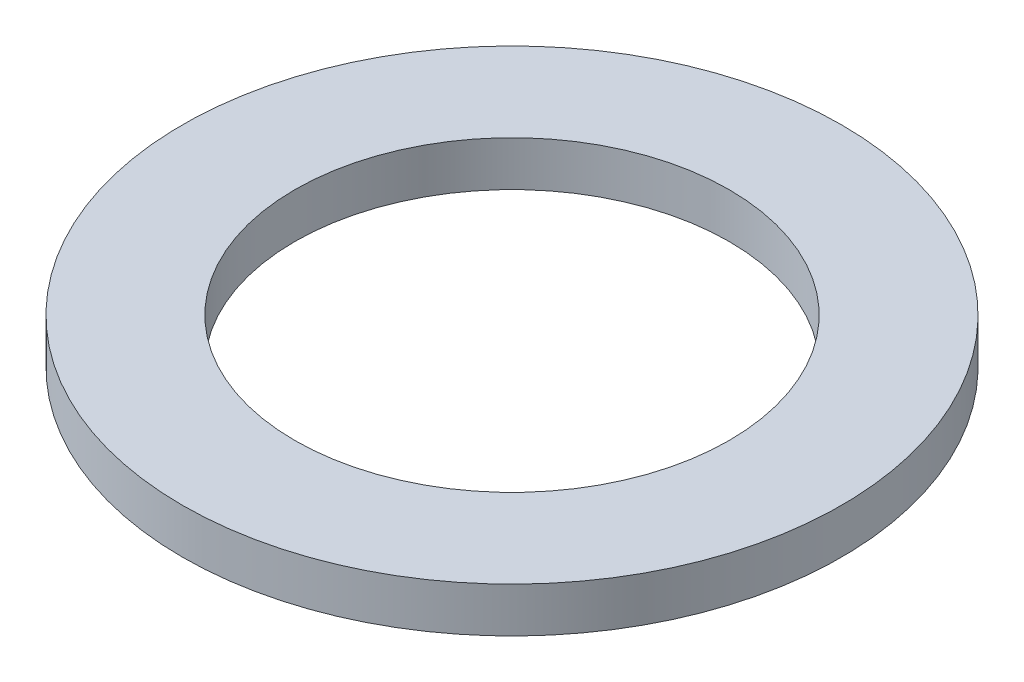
ISO-10303-21;
HEADER;
FILE_DESCRIPTION(('STEP AP214'),'2;1');
FILE_NAME('part.step','',(''),(''),'','','');
FILE_SCHEMA(('AUTOMOTIVE_DESIGN { 1 0 10303 214 1 1 1 1 }'));
ENDSEC;
DATA;
#1=APPLICATION_CONTEXT('core data for automotive mechanical design processes');
#2=APPLICATION_PROTOCOL_DEFINITION('international standard','automotive_design',2000,#1);
#3=PRODUCT_CONTEXT('',#1,'mechanical');
#4=PRODUCT('Part','Part','',(#3));
#5=PRODUCT_RELATED_PRODUCT_CATEGORY('part','',(#4));
#6=PRODUCT_DEFINITION_FORMATION('','',#4);
#7=PRODUCT_DEFINITION_CONTEXT('part definition',#1,'design');
#8=PRODUCT_DEFINITION('design','',#6,#7);
#9=PRODUCT_DEFINITION_SHAPE('','',#8);
#10=(LENGTH_UNIT() NAMED_UNIT(*) SI_UNIT(.MILLI.,.METRE.));
#11=(NAMED_UNIT(*) PLANE_ANGLE_UNIT() SI_UNIT($,.RADIAN.));
#12=(NAMED_UNIT(*) SI_UNIT($,.STERADIAN.) SOLID_ANGLE_UNIT());
#13=UNCERTAINTY_MEASURE_WITH_UNIT(LENGTH_MEASURE(1.E-05),#10,'distance_accuracy_value','');
#14=(GEOMETRIC_REPRESENTATION_CONTEXT(3) GLOBAL_UNCERTAINTY_ASSIGNED_CONTEXT((#13)) GLOBAL_UNIT_ASSIGNED_CONTEXT((#10,
#11,#12)) REPRESENTATION_CONTEXT('',''));
#15=CARTESIAN_POINT('',(0.,0.,0.));
#16=DIRECTION('',(0.,0.,1.));
#17=DIRECTION('',(1.,0.,0.));
#18=AXIS2_PLACEMENT_3D('',#15,#16,#17);
#19=CARTESIAN_POINT('',(0.,0.,0.));
#20=DIRECTION('',(0.,-1.,0.));
#21=DIRECTION('',(0.,0.,-1.));
#22=AXIS2_PLACEMENT_3D('',#19,#20,#21);
#23=CYLINDRICAL_SURFACE('',#22,7.25);
#24=CARTESIAN_POINT('',(0.,0.,0.));
#25=DIRECTION('',(0.,-1.,0.));
#26=DIRECTION('',(0.,0.,-1.));
#27=AXIS2_PLACEMENT_3D('',#24,#25,#26);
#28=CIRCLE('',#27,7.25);
#29=CARTESIAN_POINT('',(0.,0.,-7.25));
#30=VERTEX_POINT('',#29);
#31=EDGE_CURVE('E48',#30,#30,#28,.T.);
#32=ORIENTED_EDGE('',*,*,#31,.T.);
#33=EDGE_LOOP('',(#32));
#34=FACE_BOUND('',#33,.T.);
#35=CARTESIAN_POINT('',(0.,1.5,0.));
#36=DIRECTION('',(0.,-1.,0.));
#37=DIRECTION('',(0.,0.,-1.));
#38=AXIS2_PLACEMENT_3D('',#35,#36,#37);
#39=CIRCLE('',#38,7.25);
#40=CARTESIAN_POINT('',(0.,1.5,-7.25));
#41=VERTEX_POINT('',#40);
#42=EDGE_CURVE('E10',#41,#41,#39,.T.);
#43=ORIENTED_EDGE('',*,*,#42,.F.);
#44=EDGE_LOOP('',(#43));
#45=FACE_BOUND('',#44,.T.);
#46=ADVANCED_FACE('F34',(#34,#45),#23,.F.);
#47=CARTESIAN_POINT('',(7.25,1.5,0.));
#48=DIRECTION('',(0.,1.,0.));
#49=DIRECTION('',(0.,0.,1.));
#50=AXIS2_PLACEMENT_3D('',#47,#48,#49);
#51=PLANE('',#50);
#52=ORIENTED_EDGE('',*,*,#42,.T.);
#53=EDGE_LOOP('',(#52));
#54=FACE_BOUND('',#53,.T.);
#55=CARTESIAN_POINT('',(0.,1.5,0.));
#56=DIRECTION('',(0.,-1.,0.));
#57=DIRECTION('',(0.,0.,-1.));
#58=AXIS2_PLACEMENT_3D('',#55,#56,#57);
#59=CIRCLE('',#58,11.);
#60=CARTESIAN_POINT('',(0.,1.5,-11.));
#61=VERTEX_POINT('',#60);
#62=EDGE_CURVE('E40',#61,#61,#59,.T.);
#63=ORIENTED_EDGE('',*,*,#62,.F.);
#64=EDGE_LOOP('',(#63));
#65=FACE_BOUND('',#64,.T.);
#66=ADVANCED_FACE('F64',(#54,#65),#51,.T.);
#67=CARTESIAN_POINT('',(0.,0.,0.));
#68=DIRECTION('',(0.,-1.,0.));
#69=DIRECTION('',(0.,0.,-1.));
#70=AXIS2_PLACEMENT_3D('',#67,#68,#69);
#71=CYLINDRICAL_SURFACE('',#70,11.);
#72=ORIENTED_EDGE('',*,*,#62,.T.);
#73=EDGE_LOOP('',(#72));
#74=FACE_BOUND('',#73,.T.);
#75=CARTESIAN_POINT('',(0.,0.,0.));
#76=DIRECTION('',(0.,-1.,0.));
#77=DIRECTION('',(0.,0.,-1.));
#78=AXIS2_PLACEMENT_3D('',#75,#76,#77);
#79=CIRCLE('',#78,11.);
#80=CARTESIAN_POINT('',(0.,0.,-11.));
#81=VERTEX_POINT('',#80);
#82=EDGE_CURVE('E44',#81,#81,#79,.T.);
#83=ORIENTED_EDGE('',*,*,#82,.F.);
#84=EDGE_LOOP('',(#83));
#85=FACE_BOUND('',#84,.T.);
#86=ADVANCED_FACE('F58',(#74,#85),#71,.T.);
#87=CARTESIAN_POINT('',(7.25,0.,0.));
#88=DIRECTION('',(0.,-1.,0.));
#89=DIRECTION('',(0.,0.,-1.));
#90=AXIS2_PLACEMENT_3D('',#87,#88,#89);
#91=PLANE('',#90);
#92=ORIENTED_EDGE('',*,*,#82,.T.);
#93=EDGE_LOOP('',(#92));
#94=FACE_BOUND('',#93,.T.);
#95=ORIENTED_EDGE('',*,*,#31,.F.);
#96=EDGE_LOOP('',(#95));
#97=FACE_BOUND('',#96,.T.);
#98=ADVANCED_FACE('F56',(#94,#97),#91,.T.);
#99=CLOSED_SHELL('',(#46,#66,#86,#98));
#100=MANIFOLD_SOLID_BREP('B2',#99);
#101=ADVANCED_BREP_SHAPE_REPRESENTATION('',(#18,#100),#14);
#102=SHAPE_DEFINITION_REPRESENTATION(#9,#101);
ENDSEC;
END-ISO-10303-21;
